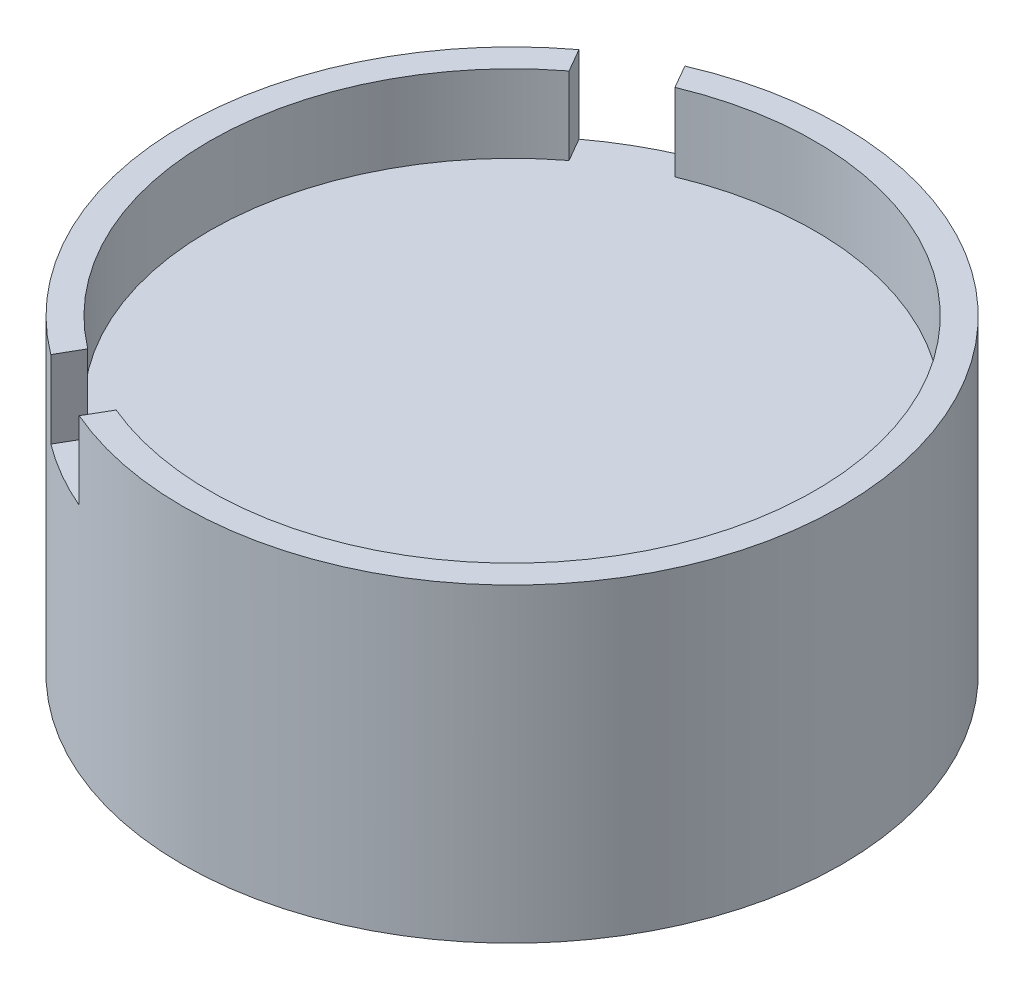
from build123d import *

# Parameters (mm, degrees)
SKETCH2_R                      = 10.625
BOSS_EXTRUDE1_DEPTH            = 5
SKETCH3_R                      = 9.76
CUT_EXTRUDE1_DEPTH             = 2.5
CUT_EXTRUDE2_DEPTH             = 2.5
F_1_8_0_1250_DOWEL_HOLE1_D     = 3.175
F_1_8_0_1250_DOWEL_HOLE1_DEPTH = 5


with BuildPart() as part:
    # Sketch2 → Boss-Extrude1 (new, symmetric)
    with BuildSketch(Plane(origin=(0, 0, 0), x_dir=(1, 0, 0), z_dir=(0, 1, 0))):
        with Locations(Location((0, 0, 0), (0, 0, 113.243672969))):
            Circle(SKETCH2_R)
    extrude(amount=BOSS_EXTRUDE1_DEPTH, both=True)

    # Sketch3 → Cut-Extrude1 (cut)
    with BuildSketch(Plane(origin=(0, 5, 0), x_dir=(1, 0, 0), z_dir=(0, 1, 0))):
        Circle(SKETCH3_R)
    extrude(amount=-CUT_EXTRUDE1_DEPTH, mode=Mode.SUBTRACT)

    # Sketch8 → Cut-Extrude2 (cut)
    with BuildSketch(Plane(origin=(0, 5, 0), x_dir=(1, 0, 0), z_dir=(0, 1, 0))):
        with BuildLine():
            Line((-4.193075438, 9.762619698), (-3.757279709, 9.007799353))
            ThreePointArc((-3.757279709, 9.007799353), (-4.88, 8.452407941), (-5.922343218, 7.757799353))
            Line((-5.922343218, 7.757799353), (-6.358138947, 8.512619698))
            ThreePointArc((-6.358138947, 8.512619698), (-5.3125, 9.201519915), (-4.193075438, 9.762619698))
        make_face()
        with BuildLine():
            Line((-3.757279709, -9.007799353), (-4.193075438, -9.762619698))
            ThreePointArc((-4.193075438, -9.762619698), (-5.3125, -9.201519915), (-6.358138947, -8.512619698))
            Line((-6.358138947, -8.512619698), (-5.922343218, -7.757799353))
            ThreePointArc((-5.922343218, -7.757799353), (-4.88, -8.452407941), (-3.757279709, -9.007799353))
        make_face()
    extrude(amount=-CUT_EXTRUDE2_DEPTH, mode=Mode.SUBTRACT)

    # 1_8 _0.1250_ Dowel Hole1
    with Locations(Plane(origin=(0, -5, 0), x_dir=(-1, 0, 0), z_dir=(0, -1, 0))):
        with Locations((0, 0)):
            Hole(F_1_8_0_1250_DOWEL_HOLE1_D / 2, depth=F_1_8_0_1250_DOWEL_HOLE1_DEPTH)


solid = part.part
